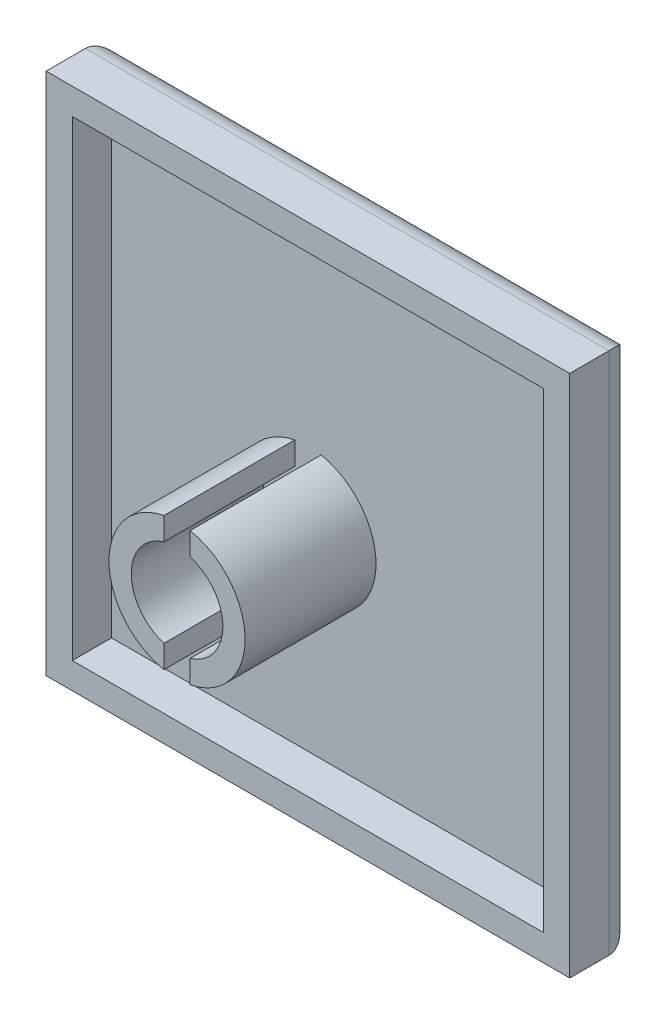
from build123d import *

# Parameters (mm, degrees)
SKETCH_1_W          = 20
SKETCH_1_H          = 20
EXTRUDE_1_DEPTH     = 1.25
FILLET_1_R          = 1
SKETCH_2_R          = 2.6
EXTRUDE_2_DEPTH     = 5
SKETCH_3_W          = 18
SKETCH_3_H          = 18
CUT_EXTRUDE_2_DEPTH = 1.5
SKETCH_4_R          = 1.75
CUT_EXTRUDE_3_DEPTH = 5
SKETCH_5_W          = 1
SKETCH_5_H          = 5
CUT_EXTRUDE_4_DEPTH = 24.217719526


with BuildPart() as part:
    # Sketch 1 → Extrude 1 (new, symmetric)
    with BuildSketch(Plane.XY):
        Rectangle(SKETCH_1_W, SKETCH_1_H)
    extrude(amount=EXTRUDE_1_DEPTH, both=True)

    # Fillet 1
    fillet_1_edges = [part.edges().sort_by_distance(p)[0] for p in [
        (0, 10, -1.25),
        (10, 0, -1.25),
        (0, -10, -1.25),
        (-10, 0, -1.25),
    ]]
    fillet(fillet_1_edges, radius=FILLET_1_R)

    # Sketch 2 → Extrude 2 (add)
    with BuildSketch(Plane.XY.offset(1.25)):
        Circle(SKETCH_2_R)
    extrude(amount=EXTRUDE_2_DEPTH)

    # Sketch 3 → Cut-Extrude 2 (cut)
    with BuildSketch(Plane.XY.offset(1.25)):
        Rectangle(SKETCH_3_W, SKETCH_3_H)
    extrude(amount=-CUT_EXTRUDE_2_DEPTH, mode=Mode.SUBTRACT)


with BuildPart() as cut_extrude_2_piece_1:
    # of the separate pieces the step leaves, piece 1, a body of its own (cut_extrude_2_pieces)
    add(part.part.solids().sort_by_distance((-10, 10, -0.25))[0])


with BuildPart() as cut_extrude_2_piece_2:
    # of the separate pieces the step leaves, piece 2, a body of its own (cut_extrude_2_pieces)
    add(part.part.solids().sort_by_distance((2.6, 0, 1.25))[0])

    # Sketch 4 → Cut-Extrude 3 (cut)
    with BuildSketch(Plane.XY.offset(6.25)):
        Circle(SKETCH_4_R)
    extrude(amount=-CUT_EXTRUDE_3_DEPTH, mode=Mode.SUBTRACT)

    # Sketch 5 → Cut-Extrude 4 (cut, through all)
    with BuildSketch(Plane.XZ.offset(10)):
        with Locations((0, 3.75)):
            Rectangle(SKETCH_5_W, SKETCH_5_H)
    extrude(amount=-CUT_EXTRUDE_4_DEPTH, mode=Mode.SUBTRACT)


with BuildPart() as cut_extrude_4_piece_1:
    # of the separate pieces the step leaves, piece 1, a body of its own (cut_extrude_4_pieces)
    add(cut_extrude_2_piece_2.part.solids().sort_by_distance((-0.5, 2.551470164, 1.25))[0])


with BuildPart() as cut_extrude_4_piece_2:
    # of the separate pieces the step leaves, piece 2, a body of its own (cut_extrude_4_pieces)
    add(cut_extrude_2_piece_2.part.solids().sort_by_distance((0.5, -2.551470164, 1.25))[0])


solid = Compound([cut_extrude_2_piece_1.part, cut_extrude_4_piece_1.part, cut_extrude_4_piece_2.part])
